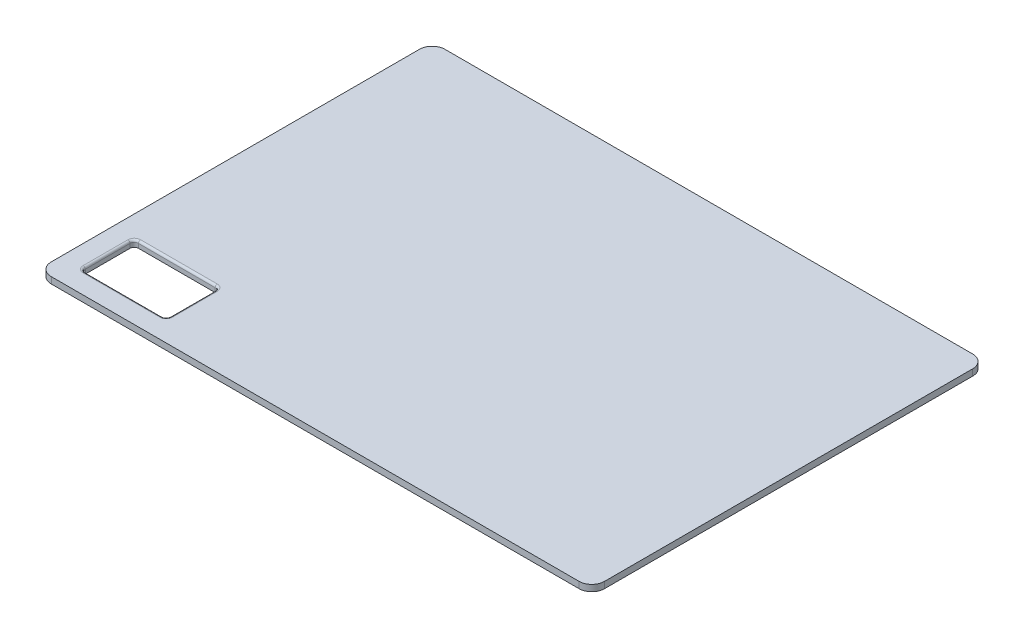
from build123d import *

# Parameters (mm, degrees)
SKETCH1_W          = 260
SKETCH1_H          = 185
EXTRUDE1_DEPTH     = 3
FILLET3_R          = 6
SKETCH2_W          = 40
SKETCH2_H          = 25
CUT_EXTRUDE1_DEPTH = 320.11439955
FILLET1_R          = 2
FILLET2_R          = 1


with BuildPart() as part:
    # Sketch1 → Extrude1 (new body)
    with BuildSketch(Plane(origin=(0, 0, 0), x_dir=(1, 0, 0), z_dir=(0, 1, 0))):
        with Locations((130, 92.5)):
            Rectangle(SKETCH1_W, SKETCH1_H)
    extrude(amount=EXTRUDE1_DEPTH)

    # Fillet3
    fillet3_edges = [part.edges().sort_by_distance(p)[0] for p in [
        (0, 1.5, -185),
        (260, 1.5, -185),
        (260, 1.5, 0),
        (0, 1.5, 0),
    ]]
    fillet(fillet3_edges, radius=FILLET3_R)

    # Sketch2 → Cut-Extrude1 (cut, through all)
    with BuildSketch(Plane(origin=(0, 3, 0), x_dir=(-1, 0, 0), z_dir=(0, 1, 0))):
        with Locations((-30, -22.5)):
            Rectangle(SKETCH2_W, SKETCH2_H)
    extrude(amount=-CUT_EXTRUDE1_DEPTH, mode=Mode.SUBTRACT)

    # Fillet1
    fillet1_edges = [part.edges().sort_by_distance(p)[0] for p in [
        (10, 1.5, -10),
        (10, 1.5, -35),
        (50, 1.5, -35),
        (50, 1.5, -10),
    ]]
    fillet(fillet1_edges, radius=FILLET1_R)

    # Fillet2
    fillet2_edges = [part.edges().sort_by_distance(p)[0] for p in [
        (30, 3, -35),
        (50, 3, -22.5),
        (30, 3, -10),
        (10, 3, -22.5),
        (49.414213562, 3, -34.414213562),
        (49.414213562, 3, -10.585786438),
        (10.585786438, 3, -10.585786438),
        (10.585786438, 3, -34.414213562),
    ]]
    fillet(fillet2_edges, radius=FILLET2_R)


solid = part.part
